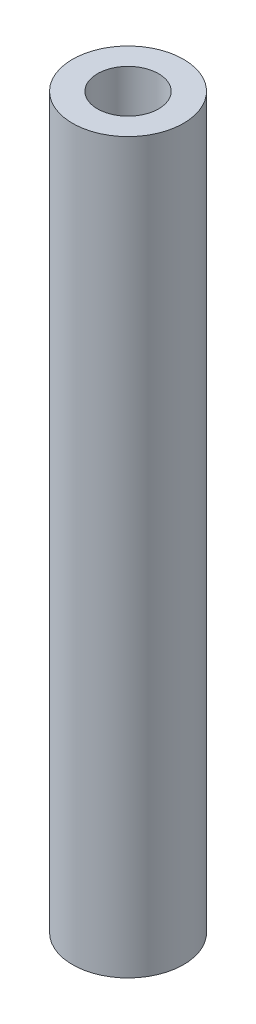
ISO-10303-21;
HEADER;
FILE_DESCRIPTION(('STEP AP214'),'2;1');
FILE_NAME('part.step','',(''),(''),'','','');
FILE_SCHEMA(('AUTOMOTIVE_DESIGN { 1 0 10303 214 1 1 1 1 }'));
ENDSEC;
DATA;
#1=APPLICATION_CONTEXT('core data for automotive mechanical design processes');
#2=APPLICATION_PROTOCOL_DEFINITION('international standard','automotive_design',2000,#1);
#3=PRODUCT_CONTEXT('',#1,'mechanical');
#4=PRODUCT('Part','Part','',(#3));
#5=PRODUCT_RELATED_PRODUCT_CATEGORY('part','',(#4));
#6=PRODUCT_DEFINITION_FORMATION('','',#4);
#7=PRODUCT_DEFINITION_CONTEXT('part definition',#1,'design');
#8=PRODUCT_DEFINITION('design','',#6,#7);
#9=PRODUCT_DEFINITION_SHAPE('','',#8);
#10=(LENGTH_UNIT() NAMED_UNIT(*) SI_UNIT(.MILLI.,.METRE.));
#11=(NAMED_UNIT(*) PLANE_ANGLE_UNIT() SI_UNIT($,.RADIAN.));
#12=(NAMED_UNIT(*) SI_UNIT($,.STERADIAN.) SOLID_ANGLE_UNIT());
#13=UNCERTAINTY_MEASURE_WITH_UNIT(LENGTH_MEASURE(1.E-05),#10,'distance_accuracy_value','');
#14=(GEOMETRIC_REPRESENTATION_CONTEXT(3) GLOBAL_UNCERTAINTY_ASSIGNED_CONTEXT((#13)) GLOBAL_UNIT_ASSIGNED_CONTEXT((#10,
#11,#12)) REPRESENTATION_CONTEXT('',''));
#15=CARTESIAN_POINT('',(0.,0.,0.));
#16=DIRECTION('',(0.,0.,1.));
#17=DIRECTION('',(1.,0.,0.));
#18=AXIS2_PLACEMENT_3D('',#15,#16,#17);
#19=CARTESIAN_POINT('',(0.,81.2499999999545,0.));
#20=DIRECTION('',(0.,1.,0.));
#21=DIRECTION('',(0.,0.,1.));
#22=AXIS2_PLACEMENT_3D('',#19,#20,#21);
#23=CONICAL_SURFACE('',#22,4.39999999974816,1.02974425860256);
#24=CARTESIAN_POINT('',(0.,78.6062132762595,0.));
#25=VERTEX_POINT('',#24);
#26=VERTEX_LOOP('',#25);
#27=FACE_BOUND('',#26,.T.);
#28=CARTESIAN_POINT('',(0.,81.25,0.));
#29=DIRECTION('',(0.,1.,0.));
#30=DIRECTION('',(0.,0.,1.));
#31=AXIS2_PLACEMENT_3D('',#28,#29,#30);
#32=CIRCLE('',#31,4.39999999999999);
#33=CARTESIAN_POINT('',(0.,81.25,4.39999999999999));
#34=VERTEX_POINT('',#33);
#35=EDGE_CURVE('E33',#34,#34,#32,.T.);
#36=ORIENTED_EDGE('',*,*,#35,.T.);
#37=EDGE_LOOP('',(#36));
#38=FACE_BOUND('',#37,.T.);
#39=ADVANCED_FACE('F17',(#27,#38),#23,.F.);
#40=CARTESIAN_POINT('',(0.,35.,0.));
#41=DIRECTION('',(0.,-1.,0.));
#42=DIRECTION('',(0.,0.,-1.));
#43=AXIS2_PLACEMENT_3D('',#40,#41,#42);
#44=PLANE('',#43);
#45=CARTESIAN_POINT('',(0.,35.,0.));
#46=DIRECTION('',(0.,-1.,0.));
#47=DIRECTION('',(0.,0.,-1.));
#48=AXIS2_PLACEMENT_3D('',#45,#46,#47);
#49=CIRCLE('',#48,3.5);
#50=CARTESIAN_POINT('',(0.,35.,-3.5));
#51=VERTEX_POINT('',#50);
#52=EDGE_CURVE('E20',#51,#51,#49,.T.);
#53=ORIENTED_EDGE('',*,*,#52,.T.);
#54=EDGE_LOOP('',(#53));
#55=FACE_BOUND('',#54,.T.);
#56=ADVANCED_FACE('F30',(#55),#44,.T.);
#57=CARTESIAN_POINT('',(0.,105.,0.));
#58=DIRECTION('',(0.,1.,0.));
#59=DIRECTION('',(0.,0.,1.));
#60=AXIS2_PLACEMENT_3D('',#57,#58,#59);
#61=CYLINDRICAL_SURFACE('',#60,4.39999999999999);
#62=CARTESIAN_POINT('',(0.,105.,0.));
#63=DIRECTION('',(0.,1.,0.));
#64=DIRECTION('',(0.,0.,1.));
#65=AXIS2_PLACEMENT_3D('',#62,#63,#64);
#66=CIRCLE('',#65,4.39999999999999);
#67=CARTESIAN_POINT('',(0.,105.,4.39999999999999));
#68=VERTEX_POINT('',#67);
#69=EDGE_CURVE('E37',#68,#68,#66,.F.);
#70=ORIENTED_EDGE('',*,*,#69,.F.);
#71=EDGE_LOOP('',(#70));
#72=FACE_BOUND('',#71,.T.);
#73=ORIENTED_EDGE('',*,*,#35,.F.);
#74=EDGE_LOOP('',(#73));
#75=FACE_BOUND('',#74,.T.);
#76=ADVANCED_FACE('F48',(#72,#75),#61,.F.);
#77=CARTESIAN_POINT('',(0.,35.,0.));
#78=DIRECTION('',(0.,-1.,0.));
#79=DIRECTION('',(0.,0.,-1.));
#80=AXIS2_PLACEMENT_3D('',#77,#78,#79);
#81=CYLINDRICAL_SURFACE('',#80,3.5);
#82=ORIENTED_EDGE('',*,*,#52,.F.);
#83=EDGE_LOOP('',(#82));
#84=FACE_BOUND('',#83,.T.);
#85=CARTESIAN_POINT('',(0.,0.,0.));
#86=DIRECTION('',(0.,-1.,0.));
#87=DIRECTION('',(0.,0.,-1.));
#88=AXIS2_PLACEMENT_3D('',#85,#86,#87);
#89=CIRCLE('',#88,3.5);
#90=CARTESIAN_POINT('',(0.,0.,-3.5));
#91=VERTEX_POINT('',#90);
#92=EDGE_CURVE('E41',#91,#91,#89,.T.);
#93=ORIENTED_EDGE('',*,*,#92,.T.);
#94=EDGE_LOOP('',(#93));
#95=FACE_BOUND('',#94,.T.);
#96=ADVANCED_FACE('F50',(#84,#95),#81,.F.);
#97=CARTESIAN_POINT('',(0.,105.,0.));
#98=DIRECTION('',(0.,1.,0.));
#99=DIRECTION('',(0.,0.,1.));
#100=AXIS2_PLACEMENT_3D('',#97,#98,#99);
#101=PLANE('',#100);
#102=CARTESIAN_POINT('',(0.,105.,0.));
#103=DIRECTION('',(0.,-1.,0.));
#104=DIRECTION('',(0.,0.,-1.));
#105=AXIS2_PLACEMENT_3D('',#102,#103,#104);
#106=CIRCLE('',#105,8.);
#107=CARTESIAN_POINT('',(0.,105.,-8.));
#108=VERTEX_POINT('',#107);
#109=EDGE_CURVE('E24',#108,#108,#106,.T.);
#110=ORIENTED_EDGE('',*,*,#109,.F.);
#111=EDGE_LOOP('',(#110));
#112=FACE_BOUND('',#111,.T.);
#113=ORIENTED_EDGE('',*,*,#69,.T.);
#114=EDGE_LOOP('',(#113));
#115=FACE_BOUND('',#114,.T.);
#116=ADVANCED_FACE('F46',(#112,#115),#101,.T.);
#117=CARTESIAN_POINT('',(0.,0.,0.));
#118=DIRECTION('',(0.,1.,0.));
#119=DIRECTION('',(0.,0.,1.));
#120=AXIS2_PLACEMENT_3D('',#117,#118,#119);
#121=PLANE('',#120);
#122=CARTESIAN_POINT('',(0.,0.,0.));
#123=DIRECTION('',(0.,-1.,0.));
#124=DIRECTION('',(0.,0.,-1.));
#125=AXIS2_PLACEMENT_3D('',#122,#123,#124);
#126=CIRCLE('',#125,8.);
#127=CARTESIAN_POINT('',(0.,0.,-8.));
#128=VERTEX_POINT('',#127);
#129=EDGE_CURVE('E11',#128,#128,#126,.F.);
#130=ORIENTED_EDGE('',*,*,#129,.F.);
#131=EDGE_LOOP('',(#130));
#132=FACE_BOUND('',#131,.T.);
#133=ORIENTED_EDGE('',*,*,#92,.F.);
#134=EDGE_LOOP('',(#133));
#135=FACE_BOUND('',#134,.T.);
#136=ADVANCED_FACE('F62',(#132,#135),#121,.F.);
#137=CARTESIAN_POINT('',(0.,105.,0.));
#138=DIRECTION('',(0.,-1.,0.));
#139=DIRECTION('',(0.,0.,-1.));
#140=AXIS2_PLACEMENT_3D('',#137,#138,#139);
#141=CYLINDRICAL_SURFACE('',#140,8.);
#142=ORIENTED_EDGE('',*,*,#129,.T.);
#143=EDGE_LOOP('',(#142));
#144=FACE_BOUND('',#143,.T.);
#145=ORIENTED_EDGE('',*,*,#109,.T.);
#146=EDGE_LOOP('',(#145));
#147=FACE_BOUND('',#146,.T.);
#148=ADVANCED_FACE('F60',(#144,#147),#141,.T.);
#149=CLOSED_SHELL('',(#39,#56,#76,#96,#116,#136,#148));
#150=MANIFOLD_SOLID_BREP('B1',#149);
#151=ADVANCED_BREP_SHAPE_REPRESENTATION('',(#18,#150),#14);
#152=SHAPE_DEFINITION_REPRESENTATION(#9,#151);
ENDSEC;
END-ISO-10303-21;
